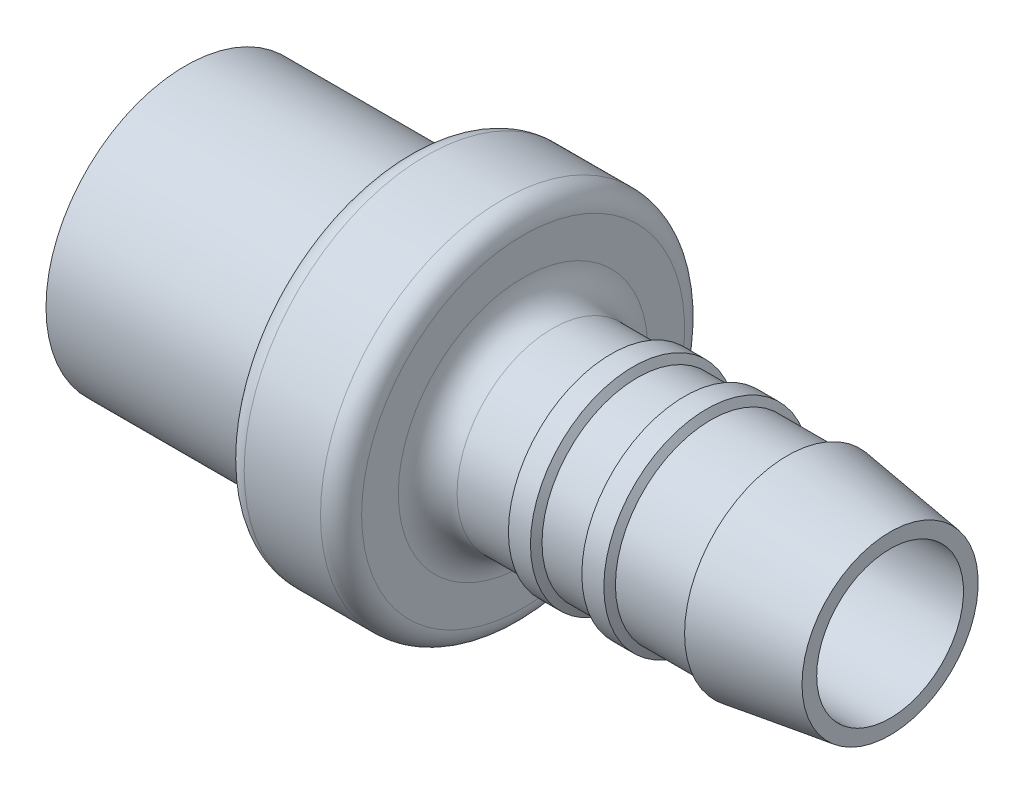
ISO-10303-21;
HEADER;
FILE_DESCRIPTION(('STEP AP214'),'2;1');
FILE_NAME('part.step','',(''),(''),'','','');
FILE_SCHEMA(('AUTOMOTIVE_DESIGN { 1 0 10303 214 1 1 1 1 }'));
ENDSEC;
DATA;
#1=APPLICATION_CONTEXT('core data for automotive mechanical design processes');
#2=APPLICATION_PROTOCOL_DEFINITION('international standard','automotive_design',2000,#1);
#3=PRODUCT_CONTEXT('',#1,'mechanical');
#4=PRODUCT('Part','Part','',(#3));
#5=PRODUCT_RELATED_PRODUCT_CATEGORY('part','',(#4));
#6=PRODUCT_DEFINITION_FORMATION('','',#4);
#7=PRODUCT_DEFINITION_CONTEXT('part definition',#1,'design');
#8=PRODUCT_DEFINITION('design','',#6,#7);
#9=PRODUCT_DEFINITION_SHAPE('','',#8);
#10=(LENGTH_UNIT() NAMED_UNIT(*) SI_UNIT(.MILLI.,.METRE.));
#11=(NAMED_UNIT(*) PLANE_ANGLE_UNIT() SI_UNIT($,.RADIAN.));
#12=(NAMED_UNIT(*) SI_UNIT($,.STERADIAN.) SOLID_ANGLE_UNIT());
#13=UNCERTAINTY_MEASURE_WITH_UNIT(LENGTH_MEASURE(1.E-05),#10,'distance_accuracy_value','');
#14=(GEOMETRIC_REPRESENTATION_CONTEXT(3) GLOBAL_UNCERTAINTY_ASSIGNED_CONTEXT((#13)) GLOBAL_UNIT_ASSIGNED_CONTEXT((#10,
#11,#12)) REPRESENTATION_CONTEXT('',''));
#15=CARTESIAN_POINT('',(0.,0.,0.));
#16=DIRECTION('',(0.,0.,1.));
#17=DIRECTION('',(1.,0.,0.));
#18=AXIS2_PLACEMENT_3D('',#15,#16,#17);
#19=CARTESIAN_POINT('',(0.,11.,0.));
#20=DIRECTION('',(1.,0.,0.));
#21=DIRECTION('',(0.,0.,-1.));
#22=AXIS2_PLACEMENT_3D('',#19,#20,#21);
#23=PLANE('',#22);
#24=CARTESIAN_POINT('',(0.,0.,0.));
#25=DIRECTION('',(-1.,0.,0.));
#26=DIRECTION('',(0.,0.,1.));
#27=AXIS2_PLACEMENT_3D('',#24,#25,#26);
#28=CIRCLE('',#27,9.5);
#29=CARTESIAN_POINT('',(0.,0.,9.5));
#30=VERTEX_POINT('',#29);
#31=EDGE_CURVE('E104',#30,#30,#28,.T.);
#32=ORIENTED_EDGE('',*,*,#31,.F.);
#33=EDGE_LOOP('',(#32));
#34=FACE_BOUND('',#33,.T.);
#35=CARTESIAN_POINT('',(0.,0.,0.));
#36=DIRECTION('',(-1.,0.,0.));
#37=DIRECTION('',(0.,0.,1.));
#38=AXIS2_PLACEMENT_3D('',#35,#36,#37);
#39=CIRCLE('',#38,11.);
#40=CARTESIAN_POINT('',(0.,0.,11.));
#41=VERTEX_POINT('',#40);
#42=EDGE_CURVE('E41',#41,#41,#39,.T.);
#43=ORIENTED_EDGE('',*,*,#42,.T.);
#44=EDGE_LOOP('',(#43));
#45=FACE_BOUND('',#44,.T.);
#46=ADVANCED_FACE('F30',(#34,#45),#23,.F.);
#47=CARTESIAN_POINT('',(1.4,0.,0.));
#48=DIRECTION('',(-1.,0.,0.));
#49=DIRECTION('',(0.,0.,1.));
#50=AXIS2_PLACEMENT_3D('',#47,#48,#49);
#51=TOROIDAL_SURFACE('',#50,11.,1.4);
#52=ORIENTED_EDGE('',*,*,#42,.F.);
#53=EDGE_LOOP('',(#52));
#54=FACE_BOUND('',#53,.T.);
#55=CARTESIAN_POINT('',(1.4,0.,0.));
#56=DIRECTION('',(-1.,0.,0.));
#57=DIRECTION('',(0.,0.,1.));
#58=AXIS2_PLACEMENT_3D('',#55,#56,#57);
#59=CIRCLE('',#58,12.4);
#60=CARTESIAN_POINT('',(1.4,0.,12.4));
#61=VERTEX_POINT('',#60);
#62=EDGE_CURVE('E45',#61,#61,#59,.T.);
#63=ORIENTED_EDGE('',*,*,#62,.T.);
#64=EDGE_LOOP('',(#63));
#65=FACE_BOUND('',#64,.T.);
#66=ADVANCED_FACE('F112',(#54,#65),#51,.T.);
#67=CARTESIAN_POINT('',(-21.3985411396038,0.,0.));
#68=DIRECTION('',(-1.,0.,0.));
#69=DIRECTION('',(0.,0.,1.));
#70=AXIS2_PLACEMENT_3D('',#67,#68,#69);
#71=CYLINDRICAL_SURFACE('',#70,12.4);
#72=ORIENTED_EDGE('',*,*,#62,.F.);
#73=EDGE_LOOP('',(#72));
#74=FACE_BOUND('',#73,.T.);
#75=CARTESIAN_POINT('',(6.6,0.,0.));
#76=DIRECTION('',(-1.,0.,0.));
#77=DIRECTION('',(0.,0.,1.));
#78=AXIS2_PLACEMENT_3D('',#75,#76,#77);
#79=CIRCLE('',#78,12.4);
#80=CARTESIAN_POINT('',(6.6,0.,12.4));
#81=VERTEX_POINT('',#80);
#82=EDGE_CURVE('E50',#81,#81,#79,.T.);
#83=ORIENTED_EDGE('',*,*,#82,.T.);
#84=EDGE_LOOP('',(#83));
#85=FACE_BOUND('',#84,.T.);
#86=ADVANCED_FACE('F117',(#74,#85),#71,.T.);
#87=CARTESIAN_POINT('',(6.6,0.,0.));
#88=DIRECTION('',(-1.,0.,0.));
#89=DIRECTION('',(0.,0.,1.));
#90=AXIS2_PLACEMENT_3D('',#87,#88,#89);
#91=TOROIDAL_SURFACE('',#90,11.,1.4);
#92=ORIENTED_EDGE('',*,*,#82,.F.);
#93=EDGE_LOOP('',(#92));
#94=FACE_BOUND('',#93,.T.);
#95=CARTESIAN_POINT('',(8.,0.,0.));
#96=DIRECTION('',(-1.,0.,0.));
#97=DIRECTION('',(0.,0.,1.));
#98=AXIS2_PLACEMENT_3D('',#95,#96,#97);
#99=CIRCLE('',#98,11.);
#100=CARTESIAN_POINT('',(8.,0.,11.));
#101=VERTEX_POINT('',#100);
#102=EDGE_CURVE('E53',#101,#101,#99,.T.);
#103=ORIENTED_EDGE('',*,*,#102,.T.);
#104=EDGE_LOOP('',(#103));
#105=FACE_BOUND('',#104,.T.);
#106=ADVANCED_FACE('F123',(#94,#105),#91,.T.);
#107=CARTESIAN_POINT('',(8.,6.5,0.));
#108=DIRECTION('',(-1.,0.,0.));
#109=DIRECTION('',(0.,0.,1.));
#110=AXIS2_PLACEMENT_3D('',#107,#108,#109);
#111=PLANE('',#110);
#112=CARTESIAN_POINT('',(8.,0.,0.));
#113=DIRECTION('',(-1.,0.,0.));
#114=DIRECTION('',(0.,0.,1.));
#115=AXIS2_PLACEMENT_3D('',#112,#113,#114);
#116=CIRCLE('',#115,8.5);
#117=CARTESIAN_POINT('',(8.,0.,8.5));
#118=VERTEX_POINT('',#117);
#119=EDGE_CURVE('E37',#118,#118,#116,.T.);
#120=ORIENTED_EDGE('',*,*,#119,.T.);
#121=EDGE_LOOP('',(#120));
#122=FACE_BOUND('',#121,.T.);
#123=ORIENTED_EDGE('',*,*,#102,.F.);
#124=EDGE_LOOP('',(#123));
#125=FACE_BOUND('',#124,.T.);
#126=ADVANCED_FACE('F129',(#122,#125),#111,.F.);
#127=CARTESIAN_POINT('',(-21.3985411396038,0.,0.));
#128=DIRECTION('',(-1.,0.,0.));
#129=DIRECTION('',(0.,0.,1.));
#130=AXIS2_PLACEMENT_3D('',#127,#128,#129);
#131=CYLINDRICAL_SURFACE('',#130,6.5);
#132=CARTESIAN_POINT('',(10.,0.,0.));
#133=DIRECTION('',(-1.,0.,0.));
#134=DIRECTION('',(0.,0.,1.));
#135=AXIS2_PLACEMENT_3D('',#132,#133,#134);
#136=CIRCLE('',#135,6.5);
#137=CARTESIAN_POINT('',(10.,0.,6.5));
#138=VERTEX_POINT('',#137);
#139=EDGE_CURVE('E10',#138,#138,#136,.F.);
#140=ORIENTED_EDGE('',*,*,#139,.T.);
#141=EDGE_LOOP('',(#140));
#142=FACE_BOUND('',#141,.T.);
#143=CARTESIAN_POINT('',(14.,0.,0.));
#144=DIRECTION('',(-1.,0.,0.));
#145=DIRECTION('',(0.,0.,1.));
#146=AXIS2_PLACEMENT_3D('',#143,#144,#145);
#147=CIRCLE('',#146,6.5);
#148=CARTESIAN_POINT('',(14.,0.,6.5));
#149=VERTEX_POINT('',#148);
#150=EDGE_CURVE('E56',#149,#149,#147,.T.);
#151=ORIENTED_EDGE('',*,*,#150,.T.);
#152=EDGE_LOOP('',(#151));
#153=FACE_BOUND('',#152,.T.);
#154=ADVANCED_FACE('F134',(#142,#153),#131,.T.);
#155=CARTESIAN_POINT('',(14.,6.5,0.));
#156=DIRECTION('',(1.,0.,0.));
#157=DIRECTION('',(0.,0.,-1.));
#158=AXIS2_PLACEMENT_3D('',#155,#156,#157);
#159=PLANE('',#158);
#160=ORIENTED_EDGE('',*,*,#150,.F.);
#161=EDGE_LOOP('',(#160));
#162=FACE_BOUND('',#161,.T.);
#163=CARTESIAN_POINT('',(14.,0.,0.));
#164=DIRECTION('',(-1.,0.,0.));
#165=DIRECTION('',(0.,0.,1.));
#166=AXIS2_PLACEMENT_3D('',#163,#164,#165);
#167=CIRCLE('',#166,7.);
#168=CARTESIAN_POINT('',(14.,0.,7.));
#169=VERTEX_POINT('',#168);
#170=EDGE_CURVE('E59',#169,#169,#167,.T.);
#171=ORIENTED_EDGE('',*,*,#170,.T.);
#172=EDGE_LOOP('',(#171));
#173=FACE_BOUND('',#172,.T.);
#174=ADVANCED_FACE('F139',(#162,#173),#159,.F.);
#175=CARTESIAN_POINT('',(-21.3985411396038,0.,0.));
#176=DIRECTION('',(-1.,0.,0.));
#177=DIRECTION('',(0.,0.,1.));
#178=AXIS2_PLACEMENT_3D('',#175,#176,#177);
#179=CYLINDRICAL_SURFACE('',#178,7.);
#180=ORIENTED_EDGE('',*,*,#170,.F.);
#181=EDGE_LOOP('',(#180));
#182=FACE_BOUND('',#181,.T.);
#183=CARTESIAN_POINT('',(15.5,0.,0.));
#184=DIRECTION('',(-1.,0.,0.));
#185=DIRECTION('',(0.,0.,1.));
#186=AXIS2_PLACEMENT_3D('',#183,#184,#185);
#187=CIRCLE('',#186,7.);
#188=CARTESIAN_POINT('',(15.5,0.,7.));
#189=VERTEX_POINT('',#188);
#190=EDGE_CURVE('E62',#189,#189,#187,.T.);
#191=ORIENTED_EDGE('',*,*,#190,.T.);
#192=EDGE_LOOP('',(#191));
#193=FACE_BOUND('',#192,.T.);
#194=ADVANCED_FACE('F144',(#182,#193),#179,.T.);
#195=CARTESIAN_POINT('',(15.7886751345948,0.,0.));
#196=DIRECTION('',(-1.,0.,0.));
#197=DIRECTION('',(0.,0.,1.));
#198=AXIS2_PLACEMENT_3D('',#195,#196,#197);
#199=CONICAL_SURFACE('',#198,6.5,1.04719755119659);
#200=ORIENTED_EDGE('',*,*,#190,.F.);
#201=EDGE_LOOP('',(#200));
#202=FACE_BOUND('',#201,.T.);
#203=CARTESIAN_POINT('',(15.7886751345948,0.,0.));
#204=DIRECTION('',(-1.,0.,0.));
#205=DIRECTION('',(0.,0.,1.));
#206=AXIS2_PLACEMENT_3D('',#203,#204,#205);
#207=CIRCLE('',#206,6.5);
#208=CARTESIAN_POINT('',(15.7886751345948,0.,6.5));
#209=VERTEX_POINT('',#208);
#210=EDGE_CURVE('E65',#209,#209,#207,.T.);
#211=ORIENTED_EDGE('',*,*,#210,.T.);
#212=EDGE_LOOP('',(#211));
#213=FACE_BOUND('',#212,.T.);
#214=ADVANCED_FACE('F148',(#202,#213),#199,.T.);
#215=CARTESIAN_POINT('',(-21.3985411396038,0.,0.));
#216=DIRECTION('',(-1.,0.,0.));
#217=DIRECTION('',(0.,0.,1.));
#218=AXIS2_PLACEMENT_3D('',#215,#216,#217);
#219=CYLINDRICAL_SURFACE('',#218,6.5);
#220=ORIENTED_EDGE('',*,*,#210,.F.);
#221=EDGE_LOOP('',(#220));
#222=FACE_BOUND('',#221,.T.);
#223=CARTESIAN_POINT('',(19.,0.,0.));
#224=DIRECTION('',(-1.,0.,0.));
#225=DIRECTION('',(0.,0.,1.));
#226=AXIS2_PLACEMENT_3D('',#223,#224,#225);
#227=CIRCLE('',#226,6.5);
#228=CARTESIAN_POINT('',(19.,0.,6.5));
#229=VERTEX_POINT('',#228);
#230=EDGE_CURVE('E68',#229,#229,#227,.T.);
#231=ORIENTED_EDGE('',*,*,#230,.T.);
#232=EDGE_LOOP('',(#231));
#233=FACE_BOUND('',#232,.T.);
#234=ADVANCED_FACE('F152',(#222,#233),#219,.T.);
#235=CARTESIAN_POINT('',(19.,6.5,0.));
#236=DIRECTION('',(1.,0.,0.));
#237=DIRECTION('',(0.,0.,-1.));
#238=AXIS2_PLACEMENT_3D('',#235,#236,#237);
#239=PLANE('',#238);
#240=ORIENTED_EDGE('',*,*,#230,.F.);
#241=EDGE_LOOP('',(#240));
#242=FACE_BOUND('',#241,.T.);
#243=CARTESIAN_POINT('',(19.,0.,0.));
#244=DIRECTION('',(-1.,0.,0.));
#245=DIRECTION('',(0.,0.,1.));
#246=AXIS2_PLACEMENT_3D('',#243,#244,#245);
#247=CIRCLE('',#246,7.);
#248=CARTESIAN_POINT('',(19.,0.,7.));
#249=VERTEX_POINT('',#248);
#250=EDGE_CURVE('E71',#249,#249,#247,.T.);
#251=ORIENTED_EDGE('',*,*,#250,.T.);
#252=EDGE_LOOP('',(#251));
#253=FACE_BOUND('',#252,.T.);
#254=ADVANCED_FACE('F156',(#242,#253),#239,.F.);
#255=CARTESIAN_POINT('',(-21.3985411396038,0.,0.));
#256=DIRECTION('',(-1.,0.,0.));
#257=DIRECTION('',(0.,0.,1.));
#258=AXIS2_PLACEMENT_3D('',#255,#256,#257);
#259=CYLINDRICAL_SURFACE('',#258,7.);
#260=ORIENTED_EDGE('',*,*,#250,.F.);
#261=EDGE_LOOP('',(#260));
#262=FACE_BOUND('',#261,.T.);
#263=CARTESIAN_POINT('',(20.5,0.,0.));
#264=DIRECTION('',(-1.,0.,0.));
#265=DIRECTION('',(0.,0.,1.));
#266=AXIS2_PLACEMENT_3D('',#263,#264,#265);
#267=CIRCLE('',#266,7.);
#268=CARTESIAN_POINT('',(20.5,0.,7.));
#269=VERTEX_POINT('',#268);
#270=EDGE_CURVE('E74',#269,#269,#267,.T.);
#271=ORIENTED_EDGE('',*,*,#270,.T.);
#272=EDGE_LOOP('',(#271));
#273=FACE_BOUND('',#272,.T.);
#274=ADVANCED_FACE('F160',(#262,#273),#259,.T.);
#275=CARTESIAN_POINT('',(20.7886751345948,0.,0.));
#276=DIRECTION('',(-1.,0.,0.));
#277=DIRECTION('',(0.,0.,1.));
#278=AXIS2_PLACEMENT_3D('',#275,#276,#277);
#279=CONICAL_SURFACE('',#278,6.5,1.0471975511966);
#280=ORIENTED_EDGE('',*,*,#270,.F.);
#281=EDGE_LOOP('',(#280));
#282=FACE_BOUND('',#281,.T.);
#283=CARTESIAN_POINT('',(20.7886751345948,0.,0.));
#284=DIRECTION('',(-1.,0.,0.));
#285=DIRECTION('',(0.,0.,1.));
#286=AXIS2_PLACEMENT_3D('',#283,#284,#285);
#287=CIRCLE('',#286,6.5);
#288=CARTESIAN_POINT('',(20.7886751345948,0.,6.5));
#289=VERTEX_POINT('',#288);
#290=EDGE_CURVE('E77',#289,#289,#287,.T.);
#291=ORIENTED_EDGE('',*,*,#290,.T.);
#292=EDGE_LOOP('',(#291));
#293=FACE_BOUND('',#292,.T.);
#294=ADVANCED_FACE('F164',(#282,#293),#279,.T.);
#295=CARTESIAN_POINT('',(-21.3985411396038,0.,0.));
#296=DIRECTION('',(-1.,0.,0.));
#297=DIRECTION('',(0.,0.,1.));
#298=AXIS2_PLACEMENT_3D('',#295,#296,#297);
#299=CYLINDRICAL_SURFACE('',#298,6.5);
#300=ORIENTED_EDGE('',*,*,#290,.F.);
#301=EDGE_LOOP('',(#300));
#302=FACE_BOUND('',#301,.T.);
#303=CARTESIAN_POINT('',(26.,0.,0.));
#304=DIRECTION('',(-1.,0.,0.));
#305=DIRECTION('',(0.,0.,1.));
#306=AXIS2_PLACEMENT_3D('',#303,#304,#305);
#307=CIRCLE('',#306,6.5);
#308=CARTESIAN_POINT('',(26.,0.,6.5));
#309=VERTEX_POINT('',#308);
#310=EDGE_CURVE('E80',#309,#309,#307,.T.);
#311=ORIENTED_EDGE('',*,*,#310,.T.);
#312=EDGE_LOOP('',(#311));
#313=FACE_BOUND('',#312,.T.);
#314=ADVANCED_FACE('F168',(#302,#313),#299,.T.);
#315=CARTESIAN_POINT('',(26.,7.,0.));
#316=DIRECTION('',(1.,0.,0.));
#317=DIRECTION('',(0.,0.,-1.));
#318=AXIS2_PLACEMENT_3D('',#315,#316,#317);
#319=PLANE('',#318);
#320=ORIENTED_EDGE('',*,*,#310,.F.);
#321=EDGE_LOOP('',(#320));
#322=FACE_BOUND('',#321,.T.);
#323=CARTESIAN_POINT('',(26.,0.,0.));
#324=DIRECTION('',(-1.,0.,0.));
#325=DIRECTION('',(0.,0.,1.));
#326=AXIS2_PLACEMENT_3D('',#323,#324,#325);
#327=CIRCLE('',#326,7.);
#328=CARTESIAN_POINT('',(26.,0.,7.));
#329=VERTEX_POINT('',#328);
#330=EDGE_CURVE('E83',#329,#329,#327,.T.);
#331=ORIENTED_EDGE('',*,*,#330,.T.);
#332=EDGE_LOOP('',(#331));
#333=FACE_BOUND('',#332,.T.);
#334=ADVANCED_FACE('F172',(#322,#333),#319,.F.);
#335=CARTESIAN_POINT('',(33.,0.,0.));
#336=DIRECTION('',(-1.,0.,0.));
#337=DIRECTION('',(0.,0.,1.));
#338=AXIS2_PLACEMENT_3D('',#335,#336,#337);
#339=CONICAL_SURFACE('',#338,6.,0.141897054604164);
#340=ORIENTED_EDGE('',*,*,#330,.F.);
#341=EDGE_LOOP('',(#340));
#342=FACE_BOUND('',#341,.T.);
#343=CARTESIAN_POINT('',(33.,0.,0.));
#344=DIRECTION('',(-1.,0.,0.));
#345=DIRECTION('',(0.,0.,1.));
#346=AXIS2_PLACEMENT_3D('',#343,#344,#345);
#347=CIRCLE('',#346,6.);
#348=CARTESIAN_POINT('',(33.,0.,6.));
#349=VERTEX_POINT('',#348);
#350=EDGE_CURVE('E86',#349,#349,#347,.T.);
#351=ORIENTED_EDGE('',*,*,#350,.T.);
#352=EDGE_LOOP('',(#351));
#353=FACE_BOUND('',#352,.T.);
#354=ADVANCED_FACE('F176',(#342,#353),#339,.T.);
#355=CARTESIAN_POINT('',(33.,5.,0.));
#356=DIRECTION('',(-1.,0.,0.));
#357=DIRECTION('',(0.,0.,1.));
#358=AXIS2_PLACEMENT_3D('',#355,#356,#357);
#359=PLANE('',#358);
#360=ORIENTED_EDGE('',*,*,#350,.F.);
#361=EDGE_LOOP('',(#360));
#362=FACE_BOUND('',#361,.T.);
#363=CARTESIAN_POINT('',(33.,0.,0.));
#364=DIRECTION('',(-1.,0.,0.));
#365=DIRECTION('',(0.,0.,1.));
#366=AXIS2_PLACEMENT_3D('',#363,#364,#365);
#367=CIRCLE('',#366,5.);
#368=CARTESIAN_POINT('',(33.,0.,5.));
#369=VERTEX_POINT('',#368);
#370=EDGE_CURVE('E89',#369,#369,#367,.T.);
#371=ORIENTED_EDGE('',*,*,#370,.T.);
#372=EDGE_LOOP('',(#371));
#373=FACE_BOUND('',#372,.T.);
#374=ADVANCED_FACE('F180',(#362,#373),#359,.F.);
#375=CARTESIAN_POINT('',(-21.3985411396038,0.,0.));
#376=DIRECTION('',(-1.,0.,0.));
#377=DIRECTION('',(0.,0.,1.));
#378=AXIS2_PLACEMENT_3D('',#375,#376,#377);
#379=CYLINDRICAL_SURFACE('',#378,5.);
#380=ORIENTED_EDGE('',*,*,#370,.F.);
#381=EDGE_LOOP('',(#380));
#382=FACE_BOUND('',#381,.T.);
#383=CARTESIAN_POINT('',(1.24231059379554,0.,0.));
#384=DIRECTION('',(-1.,0.,0.));
#385=DIRECTION('',(0.,0.,1.));
#386=AXIS2_PLACEMENT_3D('',#383,#384,#385);
#387=CIRCLE('',#386,5.);
#388=CARTESIAN_POINT('',(1.24231059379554,0.,5.));
#389=VERTEX_POINT('',#388);
#390=EDGE_CURVE('E92',#389,#389,#387,.T.);
#391=ORIENTED_EDGE('',*,*,#390,.T.);
#392=EDGE_LOOP('',(#391));
#393=FACE_BOUND('',#392,.T.);
#394=ADVANCED_FACE('F184',(#382,#393),#379,.F.);
#395=CARTESIAN_POINT('',(0.,0.,0.));
#396=DIRECTION('',(-1.,0.,0.));
#397=DIRECTION('',(0.,0.,1.));
#398=AXIS2_PLACEMENT_3D('',#395,#396,#397);
#399=CONICAL_SURFACE('',#398,6.5,0.879091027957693);
#400=ORIENTED_EDGE('',*,*,#390,.F.);
#401=EDGE_LOOP('',(#400));
#402=FACE_BOUND('',#401,.T.);
#403=CARTESIAN_POINT('',(0.,0.,0.));
#404=DIRECTION('',(-1.,0.,0.));
#405=DIRECTION('',(0.,0.,1.));
#406=AXIS2_PLACEMENT_3D('',#403,#404,#405);
#407=CIRCLE('',#406,6.5);
#408=CARTESIAN_POINT('',(0.,0.,6.5));
#409=VERTEX_POINT('',#408);
#410=EDGE_CURVE('E95',#409,#409,#407,.T.);
#411=ORIENTED_EDGE('',*,*,#410,.T.);
#412=EDGE_LOOP('',(#411));
#413=FACE_BOUND('',#412,.T.);
#414=ADVANCED_FACE('F188',(#402,#413),#399,.F.);
#415=CARTESIAN_POINT('',(-21.3985411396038,0.,0.));
#416=DIRECTION('',(-1.,0.,0.));
#417=DIRECTION('',(0.,0.,1.));
#418=AXIS2_PLACEMENT_3D('',#415,#416,#417);
#419=CYLINDRICAL_SURFACE('',#418,6.5);
#420=ORIENTED_EDGE('',*,*,#410,.F.);
#421=EDGE_LOOP('',(#420));
#422=FACE_BOUND('',#421,.T.);
#423=CARTESIAN_POINT('',(-15.,0.,0.));
#424=DIRECTION('',(-1.,0.,0.));
#425=DIRECTION('',(0.,0.,1.));
#426=AXIS2_PLACEMENT_3D('',#423,#424,#425);
#427=CIRCLE('',#426,6.5);
#428=CARTESIAN_POINT('',(-15.,0.,6.5));
#429=VERTEX_POINT('',#428);
#430=EDGE_CURVE('E98',#429,#429,#427,.T.);
#431=ORIENTED_EDGE('',*,*,#430,.T.);
#432=EDGE_LOOP('',(#431));
#433=FACE_BOUND('',#432,.T.);
#434=ADVANCED_FACE('F192',(#422,#433),#419,.F.);
#435=CARTESIAN_POINT('',(-15.,9.5,0.));
#436=DIRECTION('',(1.,0.,0.));
#437=DIRECTION('',(0.,0.,-1.));
#438=AXIS2_PLACEMENT_3D('',#435,#436,#437);
#439=PLANE('',#438);
#440=ORIENTED_EDGE('',*,*,#430,.F.);
#441=EDGE_LOOP('',(#440));
#442=FACE_BOUND('',#441,.T.);
#443=CARTESIAN_POINT('',(-15.,0.,0.));
#444=DIRECTION('',(-1.,0.,0.));
#445=DIRECTION('',(0.,0.,1.));
#446=AXIS2_PLACEMENT_3D('',#443,#444,#445);
#447=CIRCLE('',#446,9.5);
#448=CARTESIAN_POINT('',(-15.,0.,9.5));
#449=VERTEX_POINT('',#448);
#450=EDGE_CURVE('E101',#449,#449,#447,.T.);
#451=ORIENTED_EDGE('',*,*,#450,.T.);
#452=EDGE_LOOP('',(#451));
#453=FACE_BOUND('',#452,.T.);
#454=ADVANCED_FACE('F196',(#442,#453),#439,.F.);
#455=CARTESIAN_POINT('',(-21.3985411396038,0.,0.));
#456=DIRECTION('',(-1.,0.,0.));
#457=DIRECTION('',(0.,0.,1.));
#458=AXIS2_PLACEMENT_3D('',#455,#456,#457);
#459=CYLINDRICAL_SURFACE('',#458,9.5);
#460=ORIENTED_EDGE('',*,*,#450,.F.);
#461=EDGE_LOOP('',(#460));
#462=FACE_BOUND('',#461,.T.);
#463=ORIENTED_EDGE('',*,*,#31,.T.);
#464=EDGE_LOOP('',(#463));
#465=FACE_BOUND('',#464,.T.);
#466=ADVANCED_FACE('F108',(#462,#465),#459,.T.);
#467=CARTESIAN_POINT('',(10.,0.,0.));
#468=DIRECTION('',(-1.,0.,0.));
#469=DIRECTION('',(0.,0.,1.));
#470=AXIS2_PLACEMENT_3D('',#467,#468,#469);
#471=TOROIDAL_SURFACE('',#470,8.5,2.);
#472=ORIENTED_EDGE('',*,*,#139,.F.);
#473=EDGE_LOOP('',(#472));
#474=FACE_BOUND('',#473,.T.);
#475=ORIENTED_EDGE('',*,*,#119,.F.);
#476=EDGE_LOOP('',(#475));
#477=FACE_BOUND('',#476,.T.);
#478=ADVANCED_FACE('F32',(#474,#477),#471,.F.);
#479=CLOSED_SHELL('',(#46,#66,#86,#106,#126,#154,#174,#194,#214,#234,#254,#274,#294,#314,#334,
#354,#374,#394,#414,#434,#454,#466,#478));
#480=MANIFOLD_SOLID_BREP('B2',#479);
#481=ADVANCED_BREP_SHAPE_REPRESENTATION('',(#18,#480),#14);
#482=SHAPE_DEFINITION_REPRESENTATION(#9,#481);
ENDSEC;
END-ISO-10303-21;
